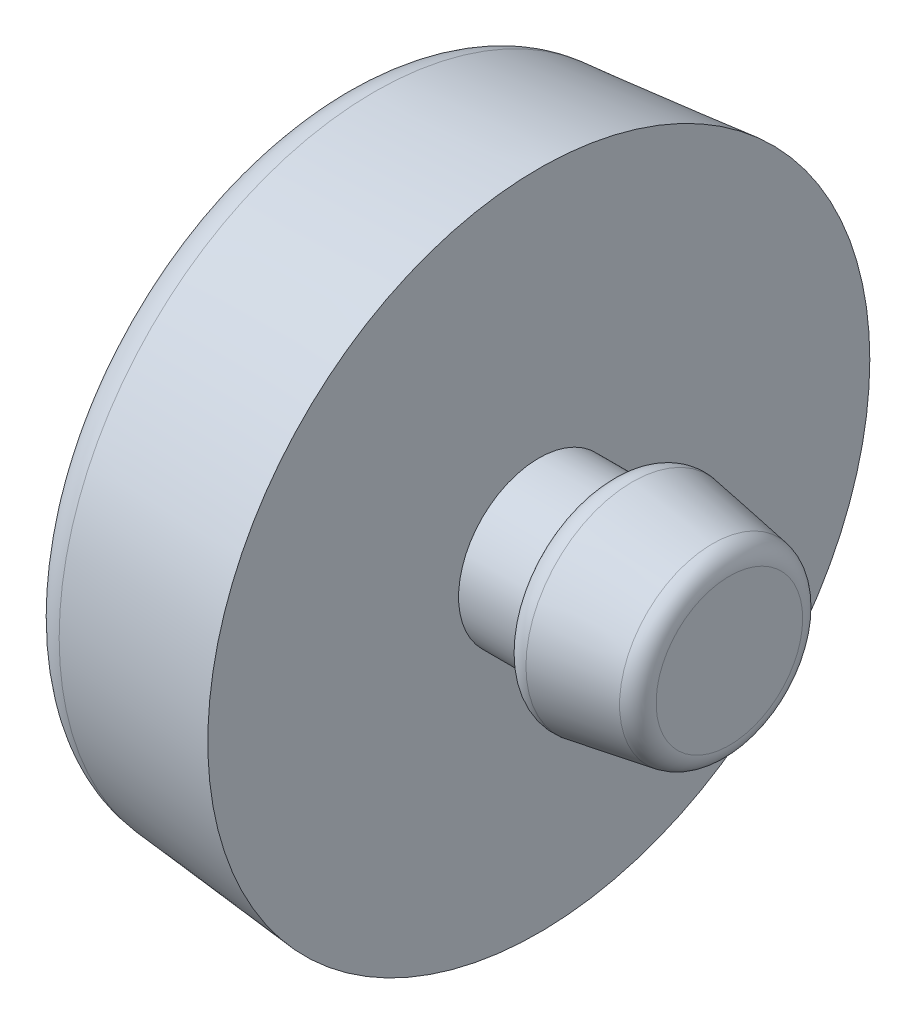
ISO-10303-21;
HEADER;
FILE_DESCRIPTION(('STEP AP214'),'2;1');
FILE_NAME('part.step','',(''),(''),'','','');
FILE_SCHEMA(('AUTOMOTIVE_DESIGN { 1 0 10303 214 1 1 1 1 }'));
ENDSEC;
DATA;
#1=APPLICATION_CONTEXT('core data for automotive mechanical design processes');
#2=APPLICATION_PROTOCOL_DEFINITION('international standard','automotive_design',2000,#1);
#3=PRODUCT_CONTEXT('',#1,'mechanical');
#4=PRODUCT('Part','Part','',(#3));
#5=PRODUCT_RELATED_PRODUCT_CATEGORY('part','',(#4));
#6=PRODUCT_DEFINITION_FORMATION('','',#4);
#7=PRODUCT_DEFINITION_CONTEXT('part definition',#1,'design');
#8=PRODUCT_DEFINITION('design','',#6,#7);
#9=PRODUCT_DEFINITION_SHAPE('','',#8);
#10=(LENGTH_UNIT() NAMED_UNIT(*) SI_UNIT(.MILLI.,.METRE.));
#11=(NAMED_UNIT(*) PLANE_ANGLE_UNIT() SI_UNIT($,.RADIAN.));
#12=(NAMED_UNIT(*) SI_UNIT($,.STERADIAN.) SOLID_ANGLE_UNIT());
#13=UNCERTAINTY_MEASURE_WITH_UNIT(LENGTH_MEASURE(1.E-05),#10,'distance_accuracy_value','');
#14=(GEOMETRIC_REPRESENTATION_CONTEXT(3) GLOBAL_UNCERTAINTY_ASSIGNED_CONTEXT((#13)) GLOBAL_UNIT_ASSIGNED_CONTEXT((#10,
#11,#12)) REPRESENTATION_CONTEXT('',''));
#15=CARTESIAN_POINT('',(0.,0.,0.));
#16=DIRECTION('',(0.,0.,1.));
#17=DIRECTION('',(1.,0.,0.));
#18=AXIS2_PLACEMENT_3D('',#15,#16,#17);
#19=CARTESIAN_POINT('',(-0.5,0.,0.));
#20=DIRECTION('',(1.,0.,0.));
#21=DIRECTION('',(0.,0.,-1.));
#22=AXIS2_PLACEMENT_3D('',#19,#20,#21);
#23=CONICAL_SURFACE('',#22,16.5,0.0949517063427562);
#24=CARTESIAN_POINT('',(-8.68961818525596,0.,0.));
#25=DIRECTION('',(-1.,0.,0.));
#26=DIRECTION('',(0.,0.,1.));
#27=AXIS2_PLACEMENT_3D('',#24,#25,#26);
#28=CIRCLE('',#27,15.7200363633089);
#29=CARTESIAN_POINT('',(-8.68961818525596,0.,15.7200363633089));
#30=VERTEX_POINT('',#29);
#31=EDGE_CURVE('E36',#30,#30,#28,.F.);
#32=ORIENTED_EDGE('',*,*,#31,.T.);
#33=EDGE_LOOP('',(#32));
#34=FACE_BOUND('',#33,.T.);
#35=CARTESIAN_POINT('',(-0.5,0.,0.));
#36=DIRECTION('',(1.,0.,0.));
#37=DIRECTION('',(0.,0.,-1.));
#38=AXIS2_PLACEMENT_3D('',#35,#36,#37);
#39=CIRCLE('',#38,16.5);
#40=CARTESIAN_POINT('',(-0.5,0.,-16.5));
#41=VERTEX_POINT('',#40);
#42=EDGE_CURVE('E55',#41,#41,#39,.T.);
#43=ORIENTED_EDGE('',*,*,#42,.F.);
#44=EDGE_LOOP('',(#43));
#45=FACE_BOUND('',#44,.T.);
#46=ADVANCED_FACE('F29',(#34,#45),#23,.T.);
#47=CARTESIAN_POINT('',(-0.499999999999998,16.5,0.));
#48=DIRECTION('',(1.,0.,0.));
#49=DIRECTION('',(0.,0.,-1.));
#50=AXIS2_PLACEMENT_3D('',#47,#48,#49);
#51=PLANE('',#50);
#52=ORIENTED_EDGE('',*,*,#42,.T.);
#53=EDGE_LOOP('',(#52));
#54=FACE_BOUND('',#53,.T.);
#55=CARTESIAN_POINT('',(-0.499999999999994,0.,0.));
#56=DIRECTION('',(1.,0.,0.));
#57=DIRECTION('',(0.,0.,-1.));
#58=AXIS2_PLACEMENT_3D('',#55,#56,#57);
#59=CIRCLE('',#58,3.99999999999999);
#60=CARTESIAN_POINT('',(-0.499999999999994,0.,-3.99999999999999));
#61=VERTEX_POINT('',#60);
#62=EDGE_CURVE('E58',#61,#61,#59,.T.);
#63=ORIENTED_EDGE('',*,*,#62,.F.);
#64=EDGE_LOOP('',(#63));
#65=FACE_BOUND('',#64,.T.);
#66=ADVANCED_FACE('F69',(#54,#65),#51,.T.);
#67=CARTESIAN_POINT('',(57.,0.,0.));
#68=DIRECTION('',(1.,0.,0.));
#69=DIRECTION('',(0.,0.,-1.));
#70=AXIS2_PLACEMENT_3D('',#67,#68,#69);
#71=CYLINDRICAL_SURFACE('',#70,3.99999999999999);
#72=ORIENTED_EDGE('',*,*,#62,.T.);
#73=EDGE_LOOP('',(#72));
#74=FACE_BOUND('',#73,.T.);
#75=CARTESIAN_POINT('',(3.,0.,0.));
#76=DIRECTION('',(1.,0.,0.));
#77=DIRECTION('',(0.,0.,-1.));
#78=AXIS2_PLACEMENT_3D('',#75,#76,#77);
#79=CIRCLE('',#78,3.99999999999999);
#80=CARTESIAN_POINT('',(3.,0.,-3.99999999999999));
#81=VERTEX_POINT('',#80);
#82=EDGE_CURVE('E61',#81,#81,#79,.T.);
#83=ORIENTED_EDGE('',*,*,#82,.F.);
#84=EDGE_LOOP('',(#83));
#85=FACE_BOUND('',#84,.T.);
#86=ADVANCED_FACE('F67',(#74,#85),#71,.T.);
#87=CARTESIAN_POINT('',(3.,3.99999999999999,0.));
#88=DIRECTION('',(-1.,0.,0.));
#89=DIRECTION('',(0.,0.,1.));
#90=AXIS2_PLACEMENT_3D('',#87,#88,#89);
#91=PLANE('',#90);
#92=CARTESIAN_POINT('',(3.,0.,0.));
#93=DIRECTION('',(-1.,0.,0.));
#94=DIRECTION('',(0.,0.,1.));
#95=AXIS2_PLACEMENT_3D('',#92,#93,#94);
#96=CIRCLE('',#95,4.31953957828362);
#97=CARTESIAN_POINT('',(3.,0.,4.31953957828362));
#98=VERTEX_POINT('',#97);
#99=EDGE_CURVE('E40',#98,#98,#96,.T.);
#100=ORIENTED_EDGE('',*,*,#99,.T.);
#101=EDGE_LOOP('',(#100));
#102=FACE_BOUND('',#101,.T.);
#103=ORIENTED_EDGE('',*,*,#82,.T.);
#104=EDGE_LOOP('',(#103));
#105=FACE_BOUND('',#104,.T.);
#106=ADVANCED_FACE('F65',(#102,#105),#91,.T.);
#107=CARTESIAN_POINT('',(9.,0.,0.));
#108=DIRECTION('',(-1.,0.,0.));
#109=DIRECTION('',(0.,0.,1.));
#110=AXIS2_PLACEMENT_3D('',#107,#108,#109);
#111=CONICAL_SURFACE('',#110,4.49999999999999,0.165148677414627);
#112=CARTESIAN_POINT('',(8.16439898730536,0.,0.));
#113=DIRECTION('',(1.,0.,0.));
#114=DIRECTION('',(0.,0.,-1.));
#115=AXIS2_PLACEMENT_3D('',#112,#113,#114);
#116=CIRCLE('',#115,4.6392668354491);
#117=CARTESIAN_POINT('',(8.16439898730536,0.,-4.6392668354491));
#118=VERTEX_POINT('',#117);
#119=EDGE_CURVE('E44',#118,#118,#116,.F.);
#120=ORIENTED_EDGE('',*,*,#119,.T.);
#121=EDGE_LOOP('',(#120));
#122=FACE_BOUND('',#121,.T.);
#123=CARTESIAN_POINT('',(4.16439898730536,0.,0.));
#124=DIRECTION('',(1.,0.,0.));
#125=DIRECTION('',(0.,0.,-1.));
#126=AXIS2_PLACEMENT_3D('',#123,#124,#125);
#127=CIRCLE('',#126,5.30593350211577);
#128=CARTESIAN_POINT('',(4.16439898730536,0.,-5.30593350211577));
#129=VERTEX_POINT('',#128);
#130=EDGE_CURVE('E49',#129,#129,#127,.T.);
#131=ORIENTED_EDGE('',*,*,#130,.T.);
#132=EDGE_LOOP('',(#131));
#133=FACE_BOUND('',#132,.T.);
#134=ADVANCED_FACE('F76',(#122,#133),#111,.T.);
#135=CARTESIAN_POINT('',(9.,4.49999999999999,0.));
#136=DIRECTION('',(1.,0.,0.));
#137=DIRECTION('',(0.,0.,-1.));
#138=AXIS2_PLACEMENT_3D('',#135,#136,#137);
#139=PLANE('',#138);
#140=CARTESIAN_POINT('',(9.,0.,0.));
#141=DIRECTION('',(1.,0.,0.));
#142=DIRECTION('',(0.,0.,-1.));
#143=AXIS2_PLACEMENT_3D('',#140,#141,#142);
#144=CIRCLE('',#143,3.65287291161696);
#145=CARTESIAN_POINT('',(9.,0.,-3.65287291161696));
#146=VERTEX_POINT('',#145);
#147=EDGE_CURVE('E52',#146,#146,#144,.T.);
#148=ORIENTED_EDGE('',*,*,#147,.T.);
#149=EDGE_LOOP('',(#148));
#150=FACE_BOUND('',#149,.T.);
#151=ADVANCED_FACE('F90',(#150),#139,.T.);
#152=CARTESIAN_POINT('',(8.,0.,0.));
#153=DIRECTION('',(1.,0.,0.));
#154=DIRECTION('',(0.,0.,-1.));
#155=AXIS2_PLACEMENT_3D('',#152,#153,#154);
#156=TOROIDAL_SURFACE('',#155,3.65287291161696,1.);
#157=ORIENTED_EDGE('',*,*,#119,.F.);
#158=EDGE_LOOP('',(#157));
#159=FACE_BOUND('',#158,.T.);
#160=ORIENTED_EDGE('',*,*,#147,.F.);
#161=EDGE_LOOP('',(#160));
#162=FACE_BOUND('',#161,.T.);
#163=ADVANCED_FACE('F87',(#159,#162),#156,.T.);
#164=CARTESIAN_POINT('',(4.,0.,0.));
#165=DIRECTION('',(-1.,0.,0.));
#166=DIRECTION('',(0.,0.,1.));
#167=AXIS2_PLACEMENT_3D('',#164,#165,#166);
#168=TOROIDAL_SURFACE('',#167,4.31953957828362,1.);
#169=ORIENTED_EDGE('',*,*,#99,.F.);
#170=EDGE_LOOP('',(#169));
#171=FACE_BOUND('',#170,.T.);
#172=ORIENTED_EDGE('',*,*,#130,.F.);
#173=EDGE_LOOP('',(#172));
#174=FACE_BOUND('',#173,.T.);
#175=ADVANCED_FACE('F89',(#171,#174),#168,.T.);
#176=CARTESIAN_POINT('',(-10.5,0.,0.));
#177=DIRECTION('',(-1.,0.,0.));
#178=DIRECTION('',(0.,0.,1.));
#179=AXIS2_PLACEMENT_3D('',#176,#177,#178);
#180=PLANE('',#179);
#181=CARTESIAN_POINT('',(-10.5,0.,0.));
#182=DIRECTION('',(-1.,0.,0.));
#183=DIRECTION('',(0.,0.,1.));
#184=AXIS2_PLACEMENT_3D('',#181,#182,#183);
#185=CIRCLE('',#184,13.729045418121);
#186=CARTESIAN_POINT('',(-10.5,0.,13.729045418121));
#187=VERTEX_POINT('',#186);
#188=EDGE_CURVE('E10',#187,#187,#185,.T.);
#189=ORIENTED_EDGE('',*,*,#188,.T.);
#190=EDGE_LOOP('',(#189));
#191=FACE_BOUND('',#190,.T.);
#192=ADVANCED_FACE('F93',(#191),#180,.T.);
#193=CARTESIAN_POINT('',(-8.5,0.,0.));
#194=DIRECTION('',(-1.,0.,0.));
#195=DIRECTION('',(0.,0.,1.));
#196=AXIS2_PLACEMENT_3D('',#193,#194,#195);
#197=TOROIDAL_SURFACE('',#196,13.729045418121,2.);
#198=ORIENTED_EDGE('',*,*,#188,.F.);
#199=EDGE_LOOP('',(#198));
#200=FACE_BOUND('',#199,.T.);
#201=ORIENTED_EDGE('',*,*,#31,.F.);
#202=EDGE_LOOP('',(#201));
#203=FACE_BOUND('',#202,.T.);
#204=ADVANCED_FACE('F31',(#200,#203),#197,.T.);
#205=CLOSED_SHELL('',(#46,#66,#86,#106,#134,#151,#163,#175,#192,#204));
#206=MANIFOLD_SOLID_BREP('B2',#205);
#207=ADVANCED_BREP_SHAPE_REPRESENTATION('',(#18,#206),#14);
#208=SHAPE_DEFINITION_REPRESENTATION(#9,#207);
ENDSEC;
END-ISO-10303-21;
